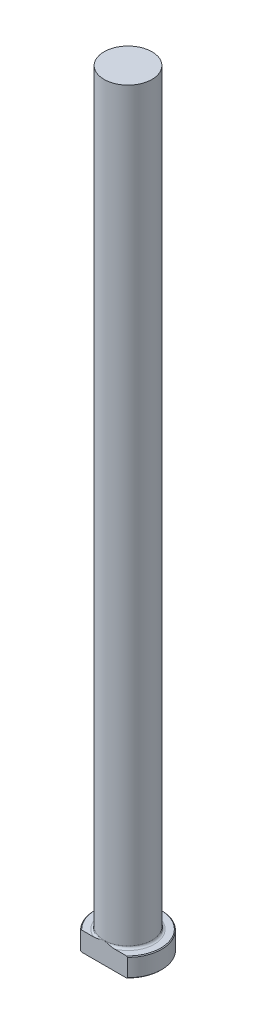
from build123d import *

# Parameters (mm, degrees)
CHAMFER1_SIZE = 0.254
FILLET1_R     = 0.762
KEY_DEPTH     = 255.485707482


with BuildPart() as part:
    # Sketch1 → Revolve1 (revolve)
    with BuildSketch(Plane.XY, mode=Mode.PRIVATE) as revolve1_sk:
        Polygon((0, 0), (-11.1125, 0), (-11.1125, 6.35), (-7.9375, 6.35), (-7.9375, 254), (0, 254), align=None)
    revolve(revolve1_sk.sketch.rotate(Axis((0, 259.958771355, 0), (0, -1, 0)), 270), axis=Axis((0, 259.958771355, 0), (0, -1, 0)))

    # Chamfer1
    chamfer1_edges = [part.edges().sort_by_distance(p)[0] for p in [
        (0, 6.35, -11.1125),
        (0, 0, -11.1125),
    ]]
    chamfer(chamfer1_edges, length=CHAMFER1_SIZE)

    # Fillet1
    fillet1_edges = [part.edges().sort_by_distance(p)[0] for p in [
        (0, 6.35, -7.9375),
    ]]
    fillet(fillet1_edges, radius=FILLET1_R)

    # Sketch2 → KEY (cut, through all)
    with BuildSketch(Plane.XZ):
        with BuildLine():
            Line((-7.777129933, 7.9375), (7.777129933, 7.9375))
            ThreePointArc((7.777129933, 7.9375), (0, 11.1125), (-7.777129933, 7.9375))
        make_face()
    extrude(amount=-KEY_DEPTH, mode=Mode.SUBTRACT)


solid = part.part
